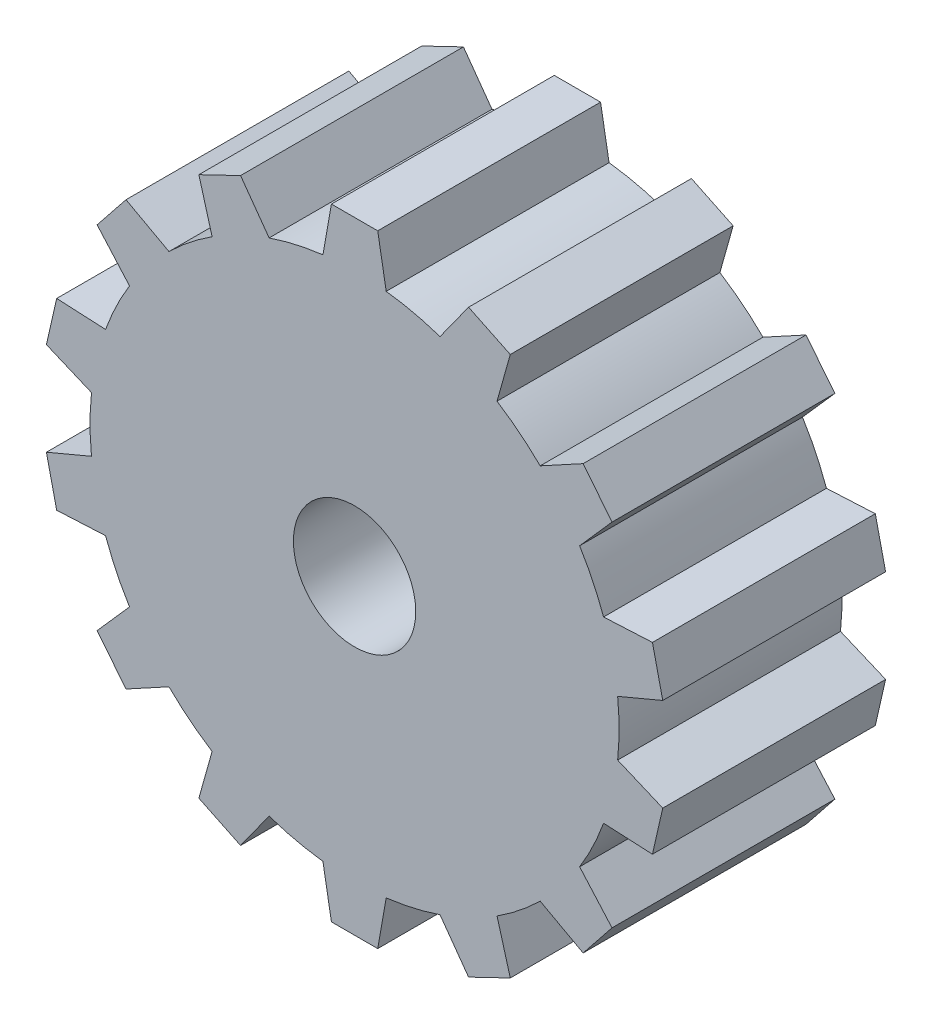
from build123d import *

# Parameters (mm, degrees)
SKETCH1_R           = 4
BOSS_EXTRUDE1_DEPTH = 3.37
SKETCH2_R           = 0.925
CUT_EXTRUDE1_DEPTH  = 3.37
BOSS_EXTRUDE3_DEPTH = 3.37
CIRPATTERN1_COUNT   = 14


with BuildPart() as part:
    # Sketch1 → Boss-Extrude1 (new body)
    with BuildSketch(Plane.XY):
        Circle(SKETCH1_R)
    extrude(amount=BOSS_EXTRUDE1_DEPTH)

    # Sketch2 → Cut-Extrude1 (cut)
    with BuildSketch(Plane.XY.offset(3.37)):
        Circle(SKETCH2_R)
    extrude(amount=-CUT_EXTRUDE1_DEPTH, mode=Mode.SUBTRACT)

    # Sketch3 → Boss-Extrude3 (add)
    with BuildSketch(Plane.XY.offset(3.37)):
        Polygon((-0.35, 4.7), (0.35, 4.7), (0.579225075, 3.4), (-0.579225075, 3.4), align=None)
    boss_extrude3 = extrude(amount=-BOSS_EXTRUDE3_DEPTH)

    # CirPattern1: Boss-Extrude3 ×14 about axis
    cirpattern1_axis = Axis((0, 0, 0), (0, 0, 1))
    for i in range(1, CIRPATTERN1_COUNT):
        add(boss_extrude3.rotate(cirpattern1_axis, i * 360 / CIRPATTERN1_COUNT))


solid = part.part
